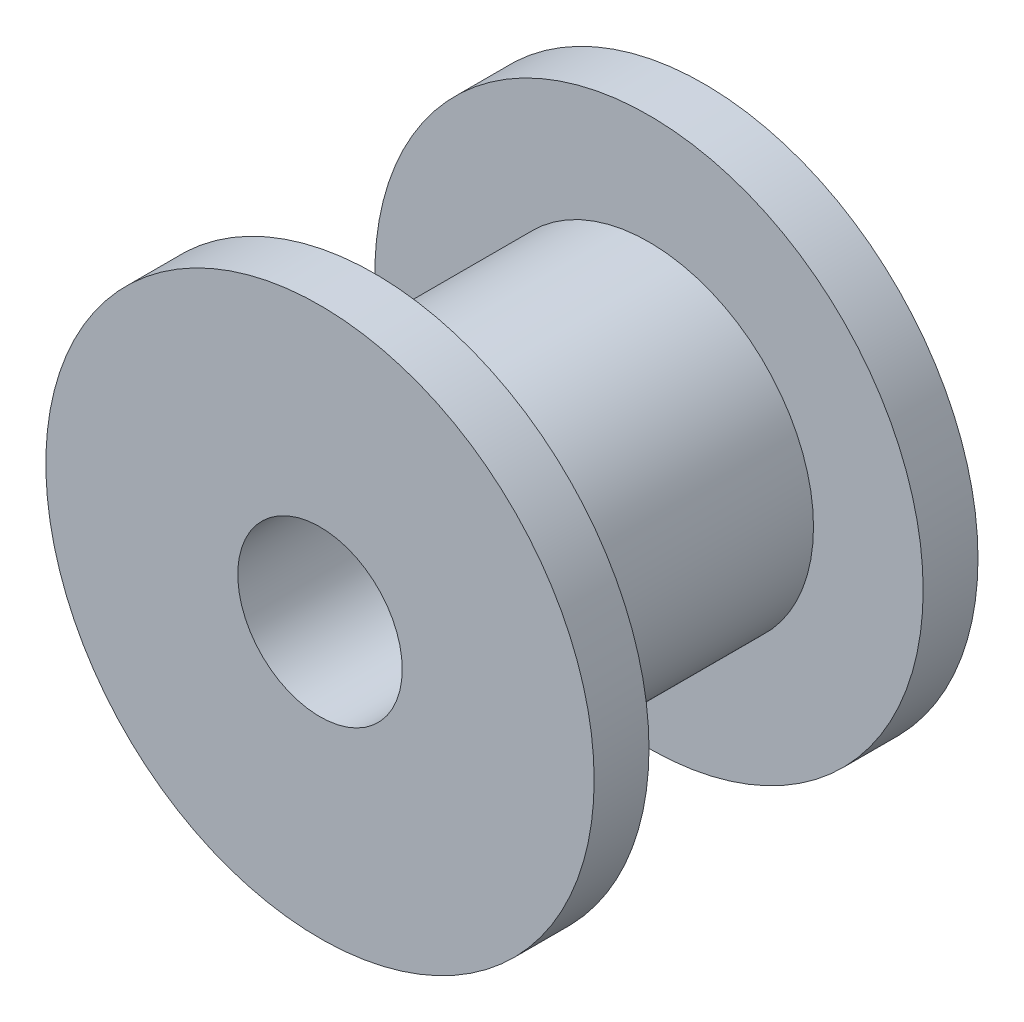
from build123d import *

# Parameters (mm, degrees)
SKETCH_1_R          = 10
EXTRUDE_1_DEPTH     = 2
SKETCH_2_R          = 6
EXTRUDE_2_DEPTH     = 10
SKETCH_3_R          = 10
EXTRUDE_3_DEPTH     = 2
SKETCH_4_R          = 3
CUT_EXTRUDE_1_DEPTH = 25


with BuildPart() as part:
    # Sketch 1 → Extrude 1 (new body)
    with BuildSketch(Plane.XY):
        Circle(SKETCH_1_R)
    extrude(amount=EXTRUDE_1_DEPTH)

    # Sketch 2 → Extrude 2 (add)
    with BuildSketch(Plane.XY.offset(2)):
        Circle(SKETCH_2_R)
    extrude(amount=EXTRUDE_2_DEPTH)

    # Sketch 3 → Extrude 3 (add)
    with BuildSketch(Plane.XY.offset(12)):
        Circle(SKETCH_3_R)
    extrude(amount=EXTRUDE_3_DEPTH)

    # Sketch 4 → Cut-Extrude 1 (cut)
    with BuildSketch(Plane.XY.offset(14)):
        Circle(SKETCH_4_R)
    extrude(amount=-CUT_EXTRUDE_1_DEPTH, mode=Mode.SUBTRACT)


solid = part.part
